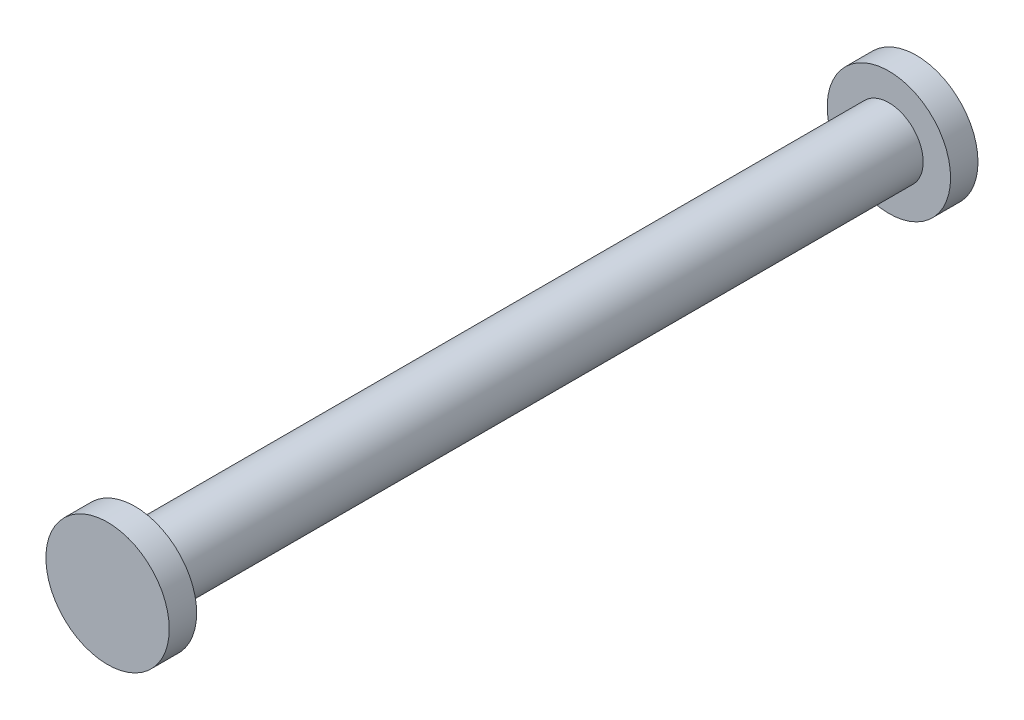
from build123d import *

# Parameters (mm, degrees)
SKETCH_1_R                       = 4.5
ARM_HINGE_PIN_BLANK_DEPTH        = 29.5
SKETCH_2_R                       = 4.6
SKETCH_2_R_2                     = 2.5
D5_SHAFT_AND_END_RETAINERS_DEPTH = 27.5


with BuildPart() as part:
    # Sketch 1 → Arm_Hinge_Pin_Blank (new, symmetric)
    with BuildSketch(Plane.XY):
        Circle(SKETCH_1_R)
    extrude(amount=ARM_HINGE_PIN_BLANK_DEPTH, both=True)

    # Sketch 2 → D5_Shaft_and_End_Retainers (cut, symmetric)
    with BuildSketch(Plane.XY):
        Circle(SKETCH_2_R)
        Circle(SKETCH_2_R_2, mode=Mode.SUBTRACT)
    extrude(amount=D5_SHAFT_AND_END_RETAINERS_DEPTH, both=True, mode=Mode.SUBTRACT)


solid = part.part
